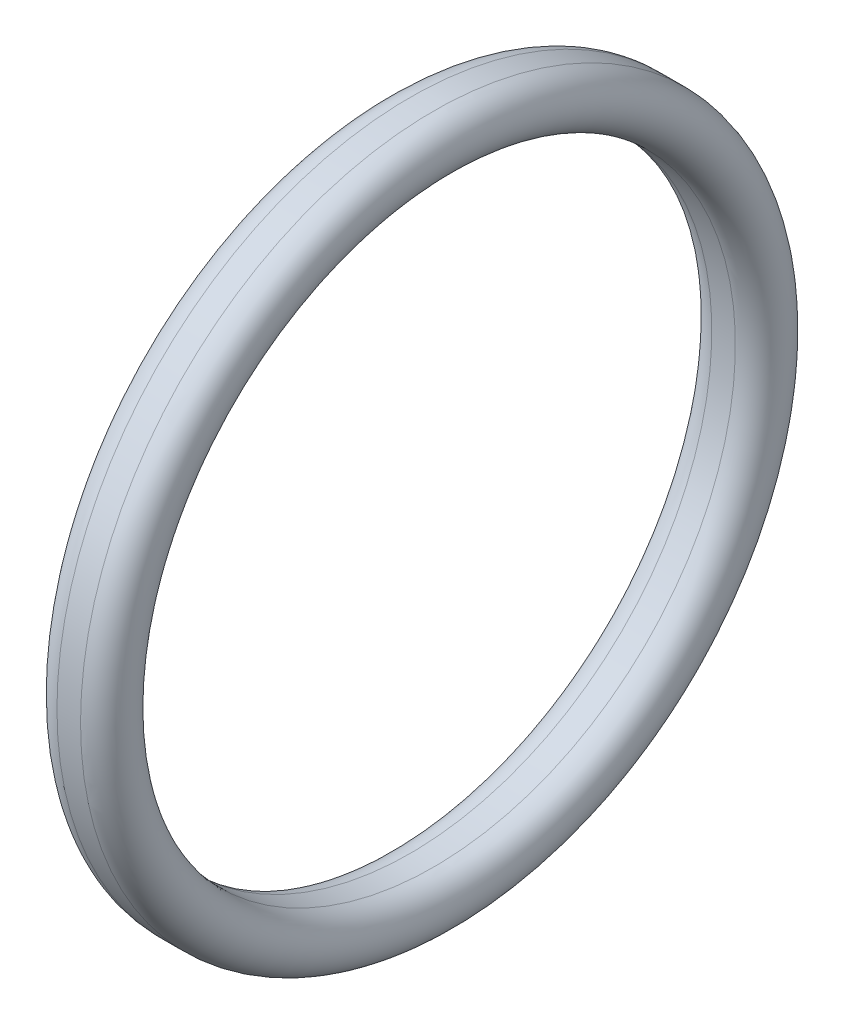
ISO-10303-21;
HEADER;
FILE_DESCRIPTION(('STEP AP214'),'2;1');
FILE_NAME('part.step','',(''),(''),'','','');
FILE_SCHEMA(('AUTOMOTIVE_DESIGN { 1 0 10303 214 1 1 1 1 }'));
ENDSEC;
DATA;
#1=APPLICATION_CONTEXT('core data for automotive mechanical design processes');
#2=APPLICATION_PROTOCOL_DEFINITION('international standard','automotive_design',2000,#1);
#3=PRODUCT_CONTEXT('',#1,'mechanical');
#4=PRODUCT('Part','Part','',(#3));
#5=PRODUCT_RELATED_PRODUCT_CATEGORY('part','',(#4));
#6=PRODUCT_DEFINITION_FORMATION('','',#4);
#7=PRODUCT_DEFINITION_CONTEXT('part definition',#1,'design');
#8=PRODUCT_DEFINITION('design','',#6,#7);
#9=PRODUCT_DEFINITION_SHAPE('','',#8);
#10=(LENGTH_UNIT() NAMED_UNIT(*) SI_UNIT(.MILLI.,.METRE.));
#11=(NAMED_UNIT(*) PLANE_ANGLE_UNIT() SI_UNIT($,.RADIAN.));
#12=(NAMED_UNIT(*) SI_UNIT($,.STERADIAN.) SOLID_ANGLE_UNIT());
#13=UNCERTAINTY_MEASURE_WITH_UNIT(LENGTH_MEASURE(1.E-05),#10,'distance_accuracy_value','');
#14=(GEOMETRIC_REPRESENTATION_CONTEXT(3) GLOBAL_UNCERTAINTY_ASSIGNED_CONTEXT((#13)) GLOBAL_UNIT_ASSIGNED_CONTEXT((#10,
#11,#12)) REPRESENTATION_CONTEXT('',''));
#15=CARTESIAN_POINT('',(0.,0.,0.));
#16=DIRECTION('',(0.,0.,1.));
#17=DIRECTION('',(1.,0.,0.));
#18=AXIS2_PLACEMENT_3D('',#15,#16,#17);
#19=CARTESIAN_POINT('',(-0.635,0.,0.));
#20=DIRECTION('',(-1.,0.,0.));
#21=DIRECTION('',(0.,0.,1.));
#22=AXIS2_PLACEMENT_3D('',#19,#20,#21);
#23=TOROIDAL_SURFACE('',#22,17.63395,1.39065);
#24=CARTESIAN_POINT('',(-0.635,0.,0.));
#25=DIRECTION('',(-1.,0.,0.));
#26=DIRECTION('',(0.,0.,1.));
#27=AXIS2_PLACEMENT_3D('',#24,#25,#26);
#28=CIRCLE('',#27,16.2433);
#29=CARTESIAN_POINT('',(-0.635,0.,16.2433));
#30=VERTEX_POINT('',#29);
#31=EDGE_CURVE('E10',#30,#30,#28,.T.);
#32=ORIENTED_EDGE('',*,*,#31,.F.);
#33=EDGE_LOOP('',(#32));
#34=FACE_BOUND('',#33,.T.);
#35=CARTESIAN_POINT('',(-0.635,0.,0.));
#36=DIRECTION('',(-1.,0.,0.));
#37=DIRECTION('',(0.,0.,1.));
#38=AXIS2_PLACEMENT_3D('',#35,#36,#37);
#39=CIRCLE('',#38,19.0246);
#40=CARTESIAN_POINT('',(-0.635,0.,19.0246));
#41=VERTEX_POINT('',#40);
#42=EDGE_CURVE('E393',#41,#41,#39,.T.);
#43=ORIENTED_EDGE('',*,*,#42,.T.);
#44=EDGE_LOOP('',(#43));
#45=FACE_BOUND('',#44,.T.);
#46=ADVANCED_FACE('F379',(#34,#45),#23,.T.);
#47=CARTESIAN_POINT('',(0.,0.,0.));
#48=DIRECTION('',(-1.,0.,0.));
#49=DIRECTION('',(0.,0.,1.));
#50=AXIS2_PLACEMENT_3D('',#47,#48,#49);
#51=CYLINDRICAL_SURFACE('',#50,16.2433);
#52=CARTESIAN_POINT('',(0.635,0.,0.));
#53=DIRECTION('',(-1.,0.,0.));
#54=DIRECTION('',(0.,0.,1.));
#55=AXIS2_PLACEMENT_3D('',#52,#53,#54);
#56=CIRCLE('',#55,16.2433);
#57=CARTESIAN_POINT('',(0.635,0.,16.2433));
#58=VERTEX_POINT('',#57);
#59=EDGE_CURVE('E385',#58,#58,#56,.T.);
#60=ORIENTED_EDGE('',*,*,#59,.F.);
#61=EDGE_LOOP('',(#60));
#62=FACE_BOUND('',#61,.T.);
#63=ORIENTED_EDGE('',*,*,#31,.T.);
#64=EDGE_LOOP('',(#63));
#65=FACE_BOUND('',#64,.T.);
#66=ADVANCED_FACE('F408',(#62,#65),#51,.F.);
#67=CARTESIAN_POINT('',(0.635,0.,0.));
#68=DIRECTION('',(-1.,0.,0.));
#69=DIRECTION('',(0.,0.,1.));
#70=AXIS2_PLACEMENT_3D('',#67,#68,#69);
#71=TOROIDAL_SURFACE('',#70,17.63395,1.39065);
#72=CARTESIAN_POINT('',(0.635,0.,0.));
#73=DIRECTION('',(-1.,0.,0.));
#74=DIRECTION('',(0.,0.,1.));
#75=AXIS2_PLACEMENT_3D('',#72,#73,#74);
#76=CIRCLE('',#75,19.0246);
#77=CARTESIAN_POINT('',(0.635,0.,19.0246));
#78=VERTEX_POINT('',#77);
#79=EDGE_CURVE('E389',#78,#78,#76,.T.);
#80=ORIENTED_EDGE('',*,*,#79,.F.);
#81=EDGE_LOOP('',(#80));
#82=FACE_BOUND('',#81,.T.);
#83=ORIENTED_EDGE('',*,*,#59,.T.);
#84=EDGE_LOOP('',(#83));
#85=FACE_BOUND('',#84,.T.);
#86=ADVANCED_FACE('F403',(#82,#85),#71,.T.);
#87=CARTESIAN_POINT('',(0.,0.,0.));
#88=DIRECTION('',(-1.,0.,0.));
#89=DIRECTION('',(0.,0.,1.));
#90=AXIS2_PLACEMENT_3D('',#87,#88,#89);
#91=CYLINDRICAL_SURFACE('',#90,19.0246);
#92=ORIENTED_EDGE('',*,*,#42,.F.);
#93=EDGE_LOOP('',(#92));
#94=FACE_BOUND('',#93,.T.);
#95=ORIENTED_EDGE('',*,*,#79,.T.);
#96=EDGE_LOOP('',(#95));
#97=FACE_BOUND('',#96,.T.);
#98=ADVANCED_FACE('F400',(#94,#97),#91,.T.);
#99=CLOSED_SHELL('',(#46,#66,#86,#98));
#100=MANIFOLD_SOLID_BREP('B2',#99);
#101=ADVANCED_BREP_SHAPE_REPRESENTATION('',(#18,#100),#14);
#102=SHAPE_DEFINITION_REPRESENTATION(#9,#101);
ENDSEC;
END-ISO-10303-21;
